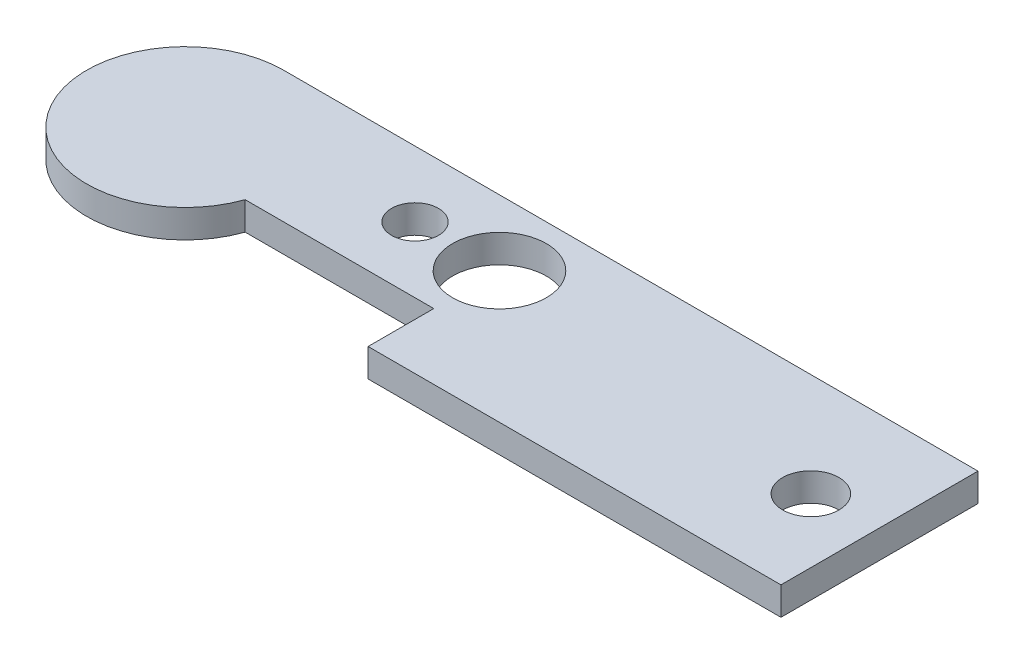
ISO-10303-21;
HEADER;
FILE_DESCRIPTION(('STEP AP214'),'2;1');
FILE_NAME('part.step','',(''),(''),'','','');
FILE_SCHEMA(('AUTOMOTIVE_DESIGN { 1 0 10303 214 1 1 1 1 }'));
ENDSEC;
DATA;
#1=APPLICATION_CONTEXT('core data for automotive mechanical design processes');
#2=APPLICATION_PROTOCOL_DEFINITION('international standard','automotive_design',2000,#1);
#3=PRODUCT_CONTEXT('',#1,'mechanical');
#4=PRODUCT('Part','Part','',(#3));
#5=PRODUCT_RELATED_PRODUCT_CATEGORY('part','',(#4));
#6=PRODUCT_DEFINITION_FORMATION('','',#4);
#7=PRODUCT_DEFINITION_CONTEXT('part definition',#1,'design');
#8=PRODUCT_DEFINITION('design','',#6,#7);
#9=PRODUCT_DEFINITION_SHAPE('','',#8);
#10=(LENGTH_UNIT() NAMED_UNIT(*) SI_UNIT(.MILLI.,.METRE.));
#11=(NAMED_UNIT(*) PLANE_ANGLE_UNIT() SI_UNIT($,.RADIAN.));
#12=(NAMED_UNIT(*) SI_UNIT($,.STERADIAN.) SOLID_ANGLE_UNIT());
#13=UNCERTAINTY_MEASURE_WITH_UNIT(LENGTH_MEASURE(1.E-05),#10,'distance_accuracy_value','');
#14=(GEOMETRIC_REPRESENTATION_CONTEXT(3) GLOBAL_UNCERTAINTY_ASSIGNED_CONTEXT((#13)) GLOBAL_UNIT_ASSIGNED_CONTEXT((#10,
#11,#12)) REPRESENTATION_CONTEXT('',''));
#15=CARTESIAN_POINT('',(0.,0.,0.));
#16=DIRECTION('',(0.,0.,1.));
#17=DIRECTION('',(1.,0.,0.));
#18=AXIS2_PLACEMENT_3D('',#15,#16,#17);
#19=CARTESIAN_POINT('',(10.5,3.,-10.5));
#20=DIRECTION('',(0.,1.,0.));
#21=DIRECTION('',(0.,0.,1.));
#22=AXIS2_PLACEMENT_3D('',#19,#20,#21);
#23=PLANE('',#22);
#24=CARTESIAN_POINT('',(40.5,3.,-14.));
#25=DIRECTION('',(0.,1.,0.));
#26=DIRECTION('',(0.,0.,1.));
#27=AXIS2_PLACEMENT_3D('',#24,#25,#26);
#28=CIRCLE('',#27,5.);
#29=CARTESIAN_POINT('',(40.5,3.,-9.00000000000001));
#30=VERTEX_POINT('',#29);
#31=EDGE_CURVE('E191',#30,#30,#28,.T.);
#32=ORIENTED_EDGE('',*,*,#31,.F.);
#33=EDGE_LOOP('',(#32));
#34=FACE_BOUND('',#33,.T.);
#35=CARTESIAN_POINT('',(10.5,3.,-10.5));
#36=DIRECTION('',(0.,1.,0.));
#37=DIRECTION('',(0.,0.,1.));
#38=AXIS2_PLACEMENT_3D('',#35,#36,#37);
#39=CIRCLE('',#38,10.5);
#40=CARTESIAN_POINT('',(10.5,3.,-21.));
#41=VERTEX_POINT('',#40);
#42=CARTESIAN_POINT('',(20.3994949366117,3.,-7.));
#43=VERTEX_POINT('',#42);
#44=EDGE_CURVE('E116',#41,#43,#39,.T.);
#45=ORIENTED_EDGE('',*,*,#44,.T.);
#46=DIRECTION('',(1.,0.,0.));
#47=VECTOR('',#46,1.);
#48=CARTESIAN_POINT('',(20.3994949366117,3.,-7.));
#49=LINE('',#48,#47);
#50=CARTESIAN_POINT('',(40.5,3.,-7.));
#51=VERTEX_POINT('',#50);
#52=EDGE_CURVE('E97',#43,#51,#49,.T.);
#53=ORIENTED_EDGE('',*,*,#52,.T.);
#54=DIRECTION('',(0.,0.,1.));
#55=VECTOR('',#54,1.);
#56=CARTESIAN_POINT('',(40.5,3.,0.));
#57=LINE('',#56,#55);
#58=CARTESIAN_POINT('',(40.5,3.,0.));
#59=VERTEX_POINT('',#58);
#60=EDGE_CURVE('E119',#51,#59,#57,.T.);
#61=ORIENTED_EDGE('',*,*,#60,.T.);
#62=DIRECTION('',(1.,0.,0.));
#63=VECTOR('',#62,1.);
#64=CARTESIAN_POINT('',(40.5,3.,0.));
#65=LINE('',#64,#63);
#66=CARTESIAN_POINT('',(84.5,3.,0.));
#67=VERTEX_POINT('',#66);
#68=EDGE_CURVE('E121',#59,#67,#65,.T.);
#69=ORIENTED_EDGE('',*,*,#68,.T.);
#70=DIRECTION('',(0.,0.,-1.));
#71=VECTOR('',#70,1.);
#72=CARTESIAN_POINT('',(84.5,3.,0.));
#73=LINE('',#72,#71);
#74=CARTESIAN_POINT('',(84.5,3.,-21.));
#75=VERTEX_POINT('',#74);
#76=EDGE_CURVE('E50',#67,#75,#73,.T.);
#77=ORIENTED_EDGE('',*,*,#76,.T.);
#78=DIRECTION('',(-1.,0.,0.));
#79=VECTOR('',#78,1.);
#80=CARTESIAN_POINT('',(10.5,3.,-21.));
#81=LINE('',#80,#79);
#82=EDGE_CURVE('E45',#75,#41,#81,.T.);
#83=ORIENTED_EDGE('',*,*,#82,.T.);
#84=EDGE_LOOP('',(#45,#53,#61,#69,#77,#83));
#85=FACE_BOUND('',#84,.T.);
#86=CARTESIAN_POINT('',(31.5,3.,-14.));
#87=DIRECTION('',(0.,1.,0.));
#88=DIRECTION('',(0.,0.,1.));
#89=AXIS2_PLACEMENT_3D('',#86,#87,#88);
#90=CIRCLE('',#89,2.5);
#91=CARTESIAN_POINT('',(31.5,3.,-11.5));
#92=VERTEX_POINT('',#91);
#93=EDGE_CURVE('E102',#92,#92,#90,.T.);
#94=ORIENTED_EDGE('',*,*,#93,.F.);
#95=EDGE_LOOP('',(#94));
#96=FACE_BOUND('',#95,.T.);
#97=CARTESIAN_POINT('',(77.6854810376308,3.,-10.));
#98=DIRECTION('',(0.,1.,0.));
#99=DIRECTION('',(0.,0.,1.));
#100=AXIS2_PLACEMENT_3D('',#97,#98,#99);
#101=CIRCLE('',#100,3.00000000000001);
#102=CARTESIAN_POINT('',(77.6854810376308,3.,-6.99999999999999));
#103=VERTEX_POINT('',#102);
#104=EDGE_CURVE('E180',#103,#103,#101,.T.);
#105=ORIENTED_EDGE('',*,*,#104,.F.);
#106=EDGE_LOOP('',(#105));
#107=FACE_BOUND('',#106,.T.);
#108=ADVANCED_FACE('F30',(#34,#85,#96,#107),#23,.T.);
#109=CARTESIAN_POINT('',(10.5,0.,-10.5));
#110=DIRECTION('',(0.,1.,0.));
#111=DIRECTION('',(0.,0.,1.));
#112=AXIS2_PLACEMENT_3D('',#109,#110,#111);
#113=PLANE('',#112);
#114=CARTESIAN_POINT('',(40.5,0.,-14.));
#115=DIRECTION('',(0.,1.,0.));
#116=DIRECTION('',(0.,0.,1.));
#117=AXIS2_PLACEMENT_3D('',#114,#115,#116);
#118=CIRCLE('',#117,5.);
#119=CARTESIAN_POINT('',(40.5,0.,-9.00000000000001));
#120=VERTEX_POINT('',#119);
#121=EDGE_CURVE('E186',#120,#120,#118,.T.);
#122=ORIENTED_EDGE('',*,*,#121,.T.);
#123=EDGE_LOOP('',(#122));
#124=FACE_BOUND('',#123,.T.);
#125=CARTESIAN_POINT('',(10.5,0.,-10.5));
#126=DIRECTION('',(0.,1.,0.));
#127=DIRECTION('',(0.,0.,1.));
#128=AXIS2_PLACEMENT_3D('',#125,#126,#127);
#129=CIRCLE('',#128,10.5);
#130=CARTESIAN_POINT('',(10.5,0.,-21.));
#131=VERTEX_POINT('',#130);
#132=CARTESIAN_POINT('',(20.3994949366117,0.,-7.));
#133=VERTEX_POINT('',#132);
#134=EDGE_CURVE('E88',#131,#133,#129,.T.);
#135=ORIENTED_EDGE('',*,*,#134,.F.);
#136=DIRECTION('',(-1.,0.,0.));
#137=VECTOR('',#136,1.);
#138=CARTESIAN_POINT('',(10.5,0.,-21.));
#139=LINE('',#138,#137);
#140=CARTESIAN_POINT('',(84.5,0.,-21.));
#141=VERTEX_POINT('',#140);
#142=EDGE_CURVE('E114',#141,#131,#139,.T.);
#143=ORIENTED_EDGE('',*,*,#142,.F.);
#144=DIRECTION('',(0.,0.,-1.));
#145=VECTOR('',#144,1.);
#146=CARTESIAN_POINT('',(84.5,0.,0.));
#147=LINE('',#146,#145);
#148=CARTESIAN_POINT('',(84.5,0.,0.));
#149=VERTEX_POINT('',#148);
#150=EDGE_CURVE('E112',#149,#141,#147,.T.);
#151=ORIENTED_EDGE('',*,*,#150,.F.);
#152=DIRECTION('',(1.,0.,0.));
#153=VECTOR('',#152,1.);
#154=CARTESIAN_POINT('',(40.5,0.,0.));
#155=LINE('',#154,#153);
#156=CARTESIAN_POINT('',(40.5,0.,0.));
#157=VERTEX_POINT('',#156);
#158=EDGE_CURVE('E110',#157,#149,#155,.T.);
#159=ORIENTED_EDGE('',*,*,#158,.F.);
#160=DIRECTION('',(0.,0.,1.));
#161=VECTOR('',#160,1.);
#162=CARTESIAN_POINT('',(40.5,0.,0.));
#163=LINE('',#162,#161);
#164=CARTESIAN_POINT('',(40.5,0.,-7.));
#165=VERTEX_POINT('',#164);
#166=EDGE_CURVE('E90',#165,#157,#163,.T.);
#167=ORIENTED_EDGE('',*,*,#166,.F.);
#168=DIRECTION('',(1.,0.,0.));
#169=VECTOR('',#168,1.);
#170=CARTESIAN_POINT('',(20.3994949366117,0.,-7.));
#171=LINE('',#170,#169);
#172=EDGE_CURVE('E83',#133,#165,#171,.T.);
#173=ORIENTED_EDGE('',*,*,#172,.F.);
#174=EDGE_LOOP('',(#135,#143,#151,#159,#167,#173));
#175=FACE_BOUND('',#174,.T.);
#176=CARTESIAN_POINT('',(31.5,0.,-14.));
#177=DIRECTION('',(0.,1.,0.));
#178=DIRECTION('',(0.,0.,1.));
#179=AXIS2_PLACEMENT_3D('',#176,#177,#178);
#180=CIRCLE('',#179,2.5);
#181=CARTESIAN_POINT('',(31.5,0.,-11.5));
#182=VERTEX_POINT('',#181);
#183=EDGE_CURVE('E105',#182,#182,#180,.T.);
#184=ORIENTED_EDGE('',*,*,#183,.T.);
#185=EDGE_LOOP('',(#184));
#186=FACE_BOUND('',#185,.T.);
#187=CARTESIAN_POINT('',(77.6854810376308,0.,-10.));
#188=DIRECTION('',(0.,1.,0.));
#189=DIRECTION('',(0.,0.,1.));
#190=AXIS2_PLACEMENT_3D('',#187,#188,#189);
#191=CIRCLE('',#190,3.00000000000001);
#192=CARTESIAN_POINT('',(77.6854810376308,0.,-6.99999999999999));
#193=VERTEX_POINT('',#192);
#194=EDGE_CURVE('E183',#193,#193,#191,.T.);
#195=ORIENTED_EDGE('',*,*,#194,.T.);
#196=EDGE_LOOP('',(#195));
#197=FACE_BOUND('',#196,.T.);
#198=ADVANCED_FACE('F84',(#124,#175,#186,#197),#113,.F.);
#199=CARTESIAN_POINT('',(10.5,3.,-10.5));
#200=DIRECTION('',(0.,-1.,0.));
#201=DIRECTION('',(0.,0.,-1.));
#202=AXIS2_PLACEMENT_3D('',#199,#200,#201);
#203=CYLINDRICAL_SURFACE('',#202,10.5);
#204=ORIENTED_EDGE('',*,*,#134,.T.);
#205=DIRECTION('',(0.,-1.,0.));
#206=VECTOR('',#205,1.);
#207=CARTESIAN_POINT('',(20.3994949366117,3.,-7.));
#208=LINE('',#207,#206);
#209=EDGE_CURVE('E11',#43,#133,#208,.T.);
#210=ORIENTED_EDGE('',*,*,#209,.F.);
#211=ORIENTED_EDGE('',*,*,#44,.F.);
#212=DIRECTION('',(0.,-1.,0.));
#213=VECTOR('',#212,1.);
#214=CARTESIAN_POINT('',(10.5,3.,-21.));
#215=LINE('',#214,#213);
#216=EDGE_CURVE('E101',#41,#131,#215,.T.);
#217=ORIENTED_EDGE('',*,*,#216,.T.);
#218=EDGE_LOOP('',(#204,#210,#211,#217));
#219=FACE_BOUND('',#218,.T.);
#220=ADVANCED_FACE('F32',(#219),#203,.T.);
#221=CARTESIAN_POINT('',(20.3994949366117,3.,-7.));
#222=DIRECTION('',(0.,0.,-1.));
#223=DIRECTION('',(-1.,0.,0.));
#224=AXIS2_PLACEMENT_3D('',#221,#222,#223);
#225=PLANE('',#224);
#226=ORIENTED_EDGE('',*,*,#172,.T.);
#227=DIRECTION('',(0.,-1.,0.));
#228=VECTOR('',#227,1.);
#229=CARTESIAN_POINT('',(40.5,3.,-7.));
#230=LINE('',#229,#228);
#231=EDGE_CURVE('E38',#51,#165,#230,.T.);
#232=ORIENTED_EDGE('',*,*,#231,.F.);
#233=ORIENTED_EDGE('',*,*,#52,.F.);
#234=ORIENTED_EDGE('',*,*,#209,.T.);
#235=EDGE_LOOP('',(#226,#232,#233,#234));
#236=FACE_BOUND('',#235,.T.);
#237=ADVANCED_FACE('F96',(#236),#225,.F.);
#238=CARTESIAN_POINT('',(40.5,3.,0.));
#239=DIRECTION('',(1.,0.,0.));
#240=DIRECTION('',(0.,0.,-1.));
#241=AXIS2_PLACEMENT_3D('',#238,#239,#240);
#242=PLANE('',#241);
#243=ORIENTED_EDGE('',*,*,#166,.T.);
#244=DIRECTION('',(0.,-1.,0.));
#245=VECTOR('',#244,1.);
#246=CARTESIAN_POINT('',(40.5,3.,0.));
#247=LINE('',#246,#245);
#248=EDGE_CURVE('E132',#59,#157,#247,.T.);
#249=ORIENTED_EDGE('',*,*,#248,.F.);
#250=ORIENTED_EDGE('',*,*,#60,.F.);
#251=ORIENTED_EDGE('',*,*,#231,.T.);
#252=EDGE_LOOP('',(#243,#249,#250,#251));
#253=FACE_BOUND('',#252,.T.);
#254=ADVANCED_FACE('F136',(#253),#242,.F.);
#255=CARTESIAN_POINT('',(40.5,3.,0.));
#256=DIRECTION('',(0.,0.,-1.));
#257=DIRECTION('',(-1.,0.,0.));
#258=AXIS2_PLACEMENT_3D('',#255,#256,#257);
#259=PLANE('',#258);
#260=ORIENTED_EDGE('',*,*,#158,.T.);
#261=DIRECTION('',(0.,-1.,0.));
#262=VECTOR('',#261,1.);
#263=CARTESIAN_POINT('',(84.5,3.,0.));
#264=LINE('',#263,#262);
#265=EDGE_CURVE('E129',#67,#149,#264,.T.);
#266=ORIENTED_EDGE('',*,*,#265,.F.);
#267=ORIENTED_EDGE('',*,*,#68,.F.);
#268=ORIENTED_EDGE('',*,*,#248,.T.);
#269=EDGE_LOOP('',(#260,#266,#267,#268));
#270=FACE_BOUND('',#269,.T.);
#271=ADVANCED_FACE('F142',(#270),#259,.F.);
#272=CARTESIAN_POINT('',(84.5,3.,0.));
#273=DIRECTION('',(-1.,0.,0.));
#274=DIRECTION('',(0.,0.,1.));
#275=AXIS2_PLACEMENT_3D('',#272,#273,#274);
#276=PLANE('',#275);
#277=ORIENTED_EDGE('',*,*,#150,.T.);
#278=DIRECTION('',(0.,-1.,0.));
#279=VECTOR('',#278,1.);
#280=CARTESIAN_POINT('',(84.5,3.,-21.));
#281=LINE('',#280,#279);
#282=EDGE_CURVE('E126',#75,#141,#281,.T.);
#283=ORIENTED_EDGE('',*,*,#282,.F.);
#284=ORIENTED_EDGE('',*,*,#76,.F.);
#285=ORIENTED_EDGE('',*,*,#265,.T.);
#286=EDGE_LOOP('',(#277,#283,#284,#285));
#287=FACE_BOUND('',#286,.T.);
#288=ADVANCED_FACE('F145',(#287),#276,.F.);
#289=CARTESIAN_POINT('',(10.5,3.,-21.));
#290=DIRECTION('',(0.,0.,1.));
#291=DIRECTION('',(1.,0.,0.));
#292=AXIS2_PLACEMENT_3D('',#289,#290,#291);
#293=PLANE('',#292);
#294=ORIENTED_EDGE('',*,*,#142,.T.);
#295=ORIENTED_EDGE('',*,*,#216,.F.);
#296=ORIENTED_EDGE('',*,*,#82,.F.);
#297=ORIENTED_EDGE('',*,*,#282,.T.);
#298=EDGE_LOOP('',(#294,#295,#296,#297));
#299=FACE_BOUND('',#298,.T.);
#300=ADVANCED_FACE('F147',(#299),#293,.F.);
#301=CARTESIAN_POINT('',(31.5,3.,-14.));
#302=DIRECTION('',(0.,-1.,0.));
#303=DIRECTION('',(0.,0.,-1.));
#304=AXIS2_PLACEMENT_3D('',#301,#302,#303);
#305=CYLINDRICAL_SURFACE('',#304,2.5);
#306=ORIENTED_EDGE('',*,*,#93,.T.);
#307=EDGE_LOOP('',(#306));
#308=FACE_BOUND('',#307,.T.);
#309=ORIENTED_EDGE('',*,*,#183,.F.);
#310=EDGE_LOOP('',(#309));
#311=FACE_BOUND('',#310,.T.);
#312=ADVANCED_FACE('F149',(#308,#311),#305,.F.);
#313=CARTESIAN_POINT('',(40.5,3.,-14.));
#314=DIRECTION('',(0.,-1.,0.));
#315=DIRECTION('',(0.,0.,-1.));
#316=AXIS2_PLACEMENT_3D('',#313,#314,#315);
#317=CYLINDRICAL_SURFACE('',#316,5.);
#318=ORIENTED_EDGE('',*,*,#31,.T.);
#319=EDGE_LOOP('',(#318));
#320=FACE_BOUND('',#319,.T.);
#321=ORIENTED_EDGE('',*,*,#121,.F.);
#322=EDGE_LOOP('',(#321));
#323=FACE_BOUND('',#322,.T.);
#324=ADVANCED_FACE('F155',(#320,#323),#317,.F.);
#325=CARTESIAN_POINT('',(77.6854810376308,3.,-10.));
#326=DIRECTION('',(0.,-1.,0.));
#327=DIRECTION('',(0.,0.,-1.));
#328=AXIS2_PLACEMENT_3D('',#325,#326,#327);
#329=CYLINDRICAL_SURFACE('',#328,3.00000000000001);
#330=ORIENTED_EDGE('',*,*,#104,.T.);
#331=EDGE_LOOP('',(#330));
#332=FACE_BOUND('',#331,.T.);
#333=ORIENTED_EDGE('',*,*,#194,.F.);
#334=EDGE_LOOP('',(#333));
#335=FACE_BOUND('',#334,.T.);
#336=ADVANCED_FACE('F171',(#332,#335),#329,.F.);
#337=CLOSED_SHELL('',(#108,#198,#220,#237,#254,#271,#288,#300,#312,#324,#336));
#338=MANIFOLD_SOLID_BREP('B2',#337);
#339=ADVANCED_BREP_SHAPE_REPRESENTATION('',(#18,#338),#14);
#340=SHAPE_DEFINITION_REPRESENTATION(#9,#339);
ENDSEC;
END-ISO-10303-21;
